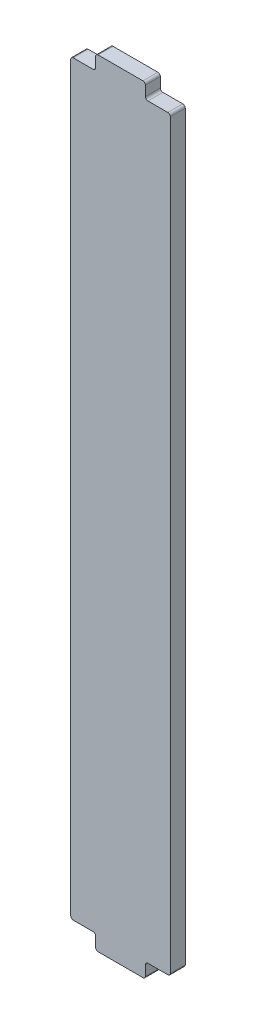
ISO-10303-21;
HEADER;
FILE_DESCRIPTION(('STEP AP214'),'2;1');
FILE_NAME('part.step','',(''),(''),'','','');
FILE_SCHEMA(('AUTOMOTIVE_DESIGN { 1 0 10303 214 1 1 1 1 }'));
ENDSEC;
DATA;
#1=APPLICATION_CONTEXT('core data for automotive mechanical design processes');
#2=APPLICATION_PROTOCOL_DEFINITION('international standard','automotive_design',2000,#1);
#3=PRODUCT_CONTEXT('',#1,'mechanical');
#4=PRODUCT('Part','Part','',(#3));
#5=PRODUCT_RELATED_PRODUCT_CATEGORY('part','',(#4));
#6=PRODUCT_DEFINITION_FORMATION('','',#4);
#7=PRODUCT_DEFINITION_CONTEXT('part definition',#1,'design');
#8=PRODUCT_DEFINITION('design','',#6,#7);
#9=PRODUCT_DEFINITION_SHAPE('','',#8);
#10=(LENGTH_UNIT() NAMED_UNIT(*) SI_UNIT(.MILLI.,.METRE.));
#11=(NAMED_UNIT(*) PLANE_ANGLE_UNIT() SI_UNIT($,.RADIAN.));
#12=(NAMED_UNIT(*) SI_UNIT($,.STERADIAN.) SOLID_ANGLE_UNIT());
#13=UNCERTAINTY_MEASURE_WITH_UNIT(LENGTH_MEASURE(1.E-05),#10,'distance_accuracy_value','');
#14=(GEOMETRIC_REPRESENTATION_CONTEXT(3) GLOBAL_UNCERTAINTY_ASSIGNED_CONTEXT((#13)) GLOBAL_UNIT_ASSIGNED_CONTEXT((#10,
#11,#12)) REPRESENTATION_CONTEXT('',''));
#15=CARTESIAN_POINT('',(0.,0.,0.));
#16=DIRECTION('',(0.,0.,1.));
#17=DIRECTION('',(1.,0.,0.));
#18=AXIS2_PLACEMENT_3D('',#15,#16,#17);
#19=CARTESIAN_POINT('',(8.99999999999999,1.,6.));
#20=DIRECTION('',(0.,0.,-1.));
#21=DIRECTION('',(-1.,0.,0.));
#22=AXIS2_PLACEMENT_3D('',#19,#20,#21);
#23=CYLINDRICAL_SURFACE('',#22,1.);
#24=CARTESIAN_POINT('',(8.99999999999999,1.,0.));
#25=DIRECTION('',(0.,0.,1.));
#26=DIRECTION('',(1.,0.,0.));
#27=AXIS2_PLACEMENT_3D('',#24,#25,#26);
#28=CIRCLE('',#27,1.);
#29=CARTESIAN_POINT('',(8.99999999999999,0.,0.));
#30=VERTEX_POINT('',#29);
#31=CARTESIAN_POINT('',(9.99999999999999,1.,0.));
#32=VERTEX_POINT('',#31);
#33=EDGE_CURVE('E231',#30,#32,#28,.T.);
#34=ORIENTED_EDGE('',*,*,#33,.T.);
#35=DIRECTION('',(0.,0.,-1.));
#36=VECTOR('',#35,1.);
#37=CARTESIAN_POINT('',(9.99999999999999,1.,6.));
#38=LINE('',#37,#36);
#39=CARTESIAN_POINT('',(9.99999999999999,1.,6.));
#40=VERTEX_POINT('',#39);
#41=EDGE_CURVE('E11',#40,#32,#38,.T.);
#42=ORIENTED_EDGE('',*,*,#41,.F.);
#43=CARTESIAN_POINT('',(8.99999999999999,1.,6.));
#44=DIRECTION('',(0.,0.,1.));
#45=DIRECTION('',(1.,0.,0.));
#46=AXIS2_PLACEMENT_3D('',#43,#44,#45);
#47=CIRCLE('',#46,1.);
#48=CARTESIAN_POINT('',(8.99999999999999,0.,6.));
#49=VERTEX_POINT('',#48);
#50=EDGE_CURVE('E277',#49,#40,#47,.T.);
#51=ORIENTED_EDGE('',*,*,#50,.F.);
#52=DIRECTION('',(0.,0.,-1.));
#53=VECTOR('',#52,1.);
#54=CARTESIAN_POINT('',(8.99999999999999,0.,6.));
#55=LINE('',#54,#53);
#56=EDGE_CURVE('E227',#49,#30,#55,.T.);
#57=ORIENTED_EDGE('',*,*,#56,.T.);
#58=EDGE_LOOP('',(#34,#42,#51,#57));
#59=FACE_BOUND('',#58,.T.);
#60=ADVANCED_FACE('F39',(#59),#23,.T.);
#61=CARTESIAN_POINT('',(9.99999999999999,1.,6.));
#62=DIRECTION('',(-1.,0.,0.));
#63=DIRECTION('',(0.,-1.,0.));
#64=AXIS2_PLACEMENT_3D('',#61,#62,#63);
#65=PLANE('',#64);
#66=DIRECTION('',(0.,1.,0.));
#67=VECTOR('',#66,1.);
#68=CARTESIAN_POINT('',(9.99999999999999,1.,0.));
#69=LINE('',#68,#67);
#70=CARTESIAN_POINT('',(9.99999999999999,5.,0.));
#71=VERTEX_POINT('',#70);
#72=EDGE_CURVE('E234',#32,#71,#69,.T.);
#73=ORIENTED_EDGE('',*,*,#72,.T.);
#74=DIRECTION('',(0.,0.,-1.));
#75=VECTOR('',#74,1.);
#76=CARTESIAN_POINT('',(9.99999999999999,5.,6.));
#77=LINE('',#76,#75);
#78=CARTESIAN_POINT('',(9.99999999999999,5.,6.));
#79=VERTEX_POINT('',#78);
#80=EDGE_CURVE('E47',#79,#71,#77,.T.);
#81=ORIENTED_EDGE('',*,*,#80,.F.);
#82=DIRECTION('',(0.,1.,0.));
#83=VECTOR('',#82,1.);
#84=CARTESIAN_POINT('',(9.99999999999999,1.,6.));
#85=LINE('',#84,#83);
#86=EDGE_CURVE('E146',#40,#79,#85,.T.);
#87=ORIENTED_EDGE('',*,*,#86,.F.);
#88=ORIENTED_EDGE('',*,*,#41,.T.);
#89=EDGE_LOOP('',(#73,#81,#87,#88));
#90=FACE_BOUND('',#89,.T.);
#91=ADVANCED_FACE('F415',(#90),#65,.F.);
#92=CARTESIAN_POINT('',(11.,5.,6.));
#93=DIRECTION('',(0.,0.,-1.));
#94=DIRECTION('',(-1.,0.,0.));
#95=AXIS2_PLACEMENT_3D('',#92,#93,#94);
#96=CYLINDRICAL_SURFACE('',#95,1.);
#97=CARTESIAN_POINT('',(11.,5.,0.));
#98=DIRECTION('',(0.,0.,-1.));
#99=DIRECTION('',(-1.,0.,0.));
#100=AXIS2_PLACEMENT_3D('',#97,#98,#99);
#101=CIRCLE('',#100,1.);
#102=CARTESIAN_POINT('',(11.,6.,0.));
#103=VERTEX_POINT('',#102);
#104=EDGE_CURVE('E236',#71,#103,#101,.T.);
#105=ORIENTED_EDGE('',*,*,#104,.T.);
#106=DIRECTION('',(0.,0.,-1.));
#107=VECTOR('',#106,1.);
#108=CARTESIAN_POINT('',(11.,6.,6.));
#109=LINE('',#108,#107);
#110=CARTESIAN_POINT('',(11.,6.,6.));
#111=VERTEX_POINT('',#110);
#112=EDGE_CURVE('E332',#111,#103,#109,.T.);
#113=ORIENTED_EDGE('',*,*,#112,.F.);
#114=CARTESIAN_POINT('',(11.,5.,6.));
#115=DIRECTION('',(0.,0.,-1.));
#116=DIRECTION('',(-1.,0.,0.));
#117=AXIS2_PLACEMENT_3D('',#114,#115,#116);
#118=CIRCLE('',#117,1.);
#119=EDGE_CURVE('E340',#79,#111,#118,.T.);
#120=ORIENTED_EDGE('',*,*,#119,.F.);
#121=ORIENTED_EDGE('',*,*,#80,.T.);
#122=EDGE_LOOP('',(#105,#113,#120,#121));
#123=FACE_BOUND('',#122,.T.);
#124=ADVANCED_FACE('F338',(#123),#96,.F.);
#125=CARTESIAN_POINT('',(11.,6.,6.));
#126=DIRECTION('',(0.,1.,0.));
#127=DIRECTION('',(-1.,0.,0.));
#128=AXIS2_PLACEMENT_3D('',#125,#126,#127);
#129=PLANE('',#128);
#130=DIRECTION('',(1.,0.,0.));
#131=VECTOR('',#130,1.);
#132=CARTESIAN_POINT('',(11.,6.,0.));
#133=LINE('',#132,#131);
#134=CARTESIAN_POINT('',(19.,6.00000000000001,0.));
#135=VERTEX_POINT('',#134);
#136=EDGE_CURVE('E238',#103,#135,#133,.T.);
#137=ORIENTED_EDGE('',*,*,#136,.T.);
#138=DIRECTION('',(0.,0.,-1.));
#139=VECTOR('',#138,1.);
#140=CARTESIAN_POINT('',(19.,6.00000000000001,6.));
#141=LINE('',#140,#139);
#142=CARTESIAN_POINT('',(19.,6.00000000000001,6.));
#143=VERTEX_POINT('',#142);
#144=EDGE_CURVE('E329',#143,#135,#141,.T.);
#145=ORIENTED_EDGE('',*,*,#144,.F.);
#146=DIRECTION('',(1.,0.,0.));
#147=VECTOR('',#146,1.);
#148=CARTESIAN_POINT('',(11.,6.,6.));
#149=LINE('',#148,#147);
#150=EDGE_CURVE('E358',#111,#143,#149,.T.);
#151=ORIENTED_EDGE('',*,*,#150,.F.);
#152=ORIENTED_EDGE('',*,*,#112,.T.);
#153=EDGE_LOOP('',(#137,#145,#151,#152));
#154=FACE_BOUND('',#153,.T.);
#155=ADVANCED_FACE('F349',(#154),#129,.F.);
#156=CARTESIAN_POINT('',(19.,7.00000000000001,6.));
#157=DIRECTION('',(0.,0.,-1.));
#158=DIRECTION('',(-1.,0.,0.));
#159=AXIS2_PLACEMENT_3D('',#156,#157,#158);
#160=CYLINDRICAL_SURFACE('',#159,0.999999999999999);
#161=CARTESIAN_POINT('',(19.,7.00000000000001,0.));
#162=DIRECTION('',(0.,0.,1.));
#163=DIRECTION('',(1.,0.,0.));
#164=AXIS2_PLACEMENT_3D('',#161,#162,#163);
#165=CIRCLE('',#164,0.999999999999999);
#166=CARTESIAN_POINT('',(20.,7.00000000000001,0.));
#167=VERTEX_POINT('',#166);
#168=EDGE_CURVE('E240',#135,#167,#165,.T.);
#169=ORIENTED_EDGE('',*,*,#168,.T.);
#170=DIRECTION('',(0.,0.,-1.));
#171=VECTOR('',#170,1.);
#172=CARTESIAN_POINT('',(20.,7.00000000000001,6.));
#173=LINE('',#172,#171);
#174=CARTESIAN_POINT('',(20.,7.00000000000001,6.));
#175=VERTEX_POINT('',#174);
#176=EDGE_CURVE('E326',#175,#167,#173,.T.);
#177=ORIENTED_EDGE('',*,*,#176,.F.);
#178=CARTESIAN_POINT('',(19.,7.00000000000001,6.));
#179=DIRECTION('',(0.,0.,1.));
#180=DIRECTION('',(1.,0.,0.));
#181=AXIS2_PLACEMENT_3D('',#178,#179,#180);
#182=CIRCLE('',#181,0.999999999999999);
#183=EDGE_CURVE('E355',#143,#175,#182,.T.);
#184=ORIENTED_EDGE('',*,*,#183,.F.);
#185=ORIENTED_EDGE('',*,*,#144,.T.);
#186=EDGE_LOOP('',(#169,#177,#184,#185));
#187=FACE_BOUND('',#186,.T.);
#188=ADVANCED_FACE('F353',(#187),#160,.T.);
#189=CARTESIAN_POINT('',(20.,7.00000000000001,6.));
#190=DIRECTION('',(-1.,0.,0.));
#191=DIRECTION('',(0.,-1.,0.));
#192=AXIS2_PLACEMENT_3D('',#189,#190,#191);
#193=PLANE('',#192);
#194=DIRECTION('',(0.,1.,0.));
#195=VECTOR('',#194,1.);
#196=CARTESIAN_POINT('',(20.,7.00000000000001,0.));
#197=LINE('',#196,#195);
#198=CARTESIAN_POINT('',(20.,305.,0.));
#199=VERTEX_POINT('',#198);
#200=EDGE_CURVE('E242',#167,#199,#197,.T.);
#201=ORIENTED_EDGE('',*,*,#200,.T.);
#202=DIRECTION('',(0.,0.,-1.));
#203=VECTOR('',#202,1.);
#204=CARTESIAN_POINT('',(20.,305.,6.));
#205=LINE('',#204,#203);
#206=CARTESIAN_POINT('',(20.,305.,6.));
#207=VERTEX_POINT('',#206);
#208=EDGE_CURVE('E323',#207,#199,#205,.T.);
#209=ORIENTED_EDGE('',*,*,#208,.F.);
#210=DIRECTION('',(0.,1.,0.));
#211=VECTOR('',#210,1.);
#212=CARTESIAN_POINT('',(20.,7.00000000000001,6.));
#213=LINE('',#212,#211);
#214=EDGE_CURVE('E357',#175,#207,#213,.T.);
#215=ORIENTED_EDGE('',*,*,#214,.F.);
#216=ORIENTED_EDGE('',*,*,#176,.T.);
#217=EDGE_LOOP('',(#201,#209,#215,#216));
#218=FACE_BOUND('',#217,.T.);
#219=ADVANCED_FACE('F428',(#218),#193,.F.);
#220=CARTESIAN_POINT('',(19.,305.,6.));
#221=DIRECTION('',(0.,0.,-1.));
#222=DIRECTION('',(-1.,0.,0.));
#223=AXIS2_PLACEMENT_3D('',#220,#221,#222);
#224=CYLINDRICAL_SURFACE('',#223,1.);
#225=CARTESIAN_POINT('',(19.,305.,0.));
#226=DIRECTION('',(0.,0.,1.));
#227=DIRECTION('',(1.,0.,0.));
#228=AXIS2_PLACEMENT_3D('',#225,#226,#227);
#229=CIRCLE('',#228,1.);
#230=CARTESIAN_POINT('',(19.,306.,0.));
#231=VERTEX_POINT('',#230);
#232=EDGE_CURVE('E244',#199,#231,#229,.T.);
#233=ORIENTED_EDGE('',*,*,#232,.T.);
#234=DIRECTION('',(0.,0.,-1.));
#235=VECTOR('',#234,1.);
#236=CARTESIAN_POINT('',(19.,306.,6.));
#237=LINE('',#236,#235);
#238=CARTESIAN_POINT('',(19.,306.,6.));
#239=VERTEX_POINT('',#238);
#240=EDGE_CURVE('E320',#239,#231,#237,.T.);
#241=ORIENTED_EDGE('',*,*,#240,.F.);
#242=CARTESIAN_POINT('',(19.,305.,6.));
#243=DIRECTION('',(0.,0.,1.));
#244=DIRECTION('',(1.,0.,0.));
#245=AXIS2_PLACEMENT_3D('',#242,#243,#244);
#246=CIRCLE('',#245,1.);
#247=EDGE_CURVE('E360',#207,#239,#246,.T.);
#248=ORIENTED_EDGE('',*,*,#247,.F.);
#249=ORIENTED_EDGE('',*,*,#208,.T.);
#250=EDGE_LOOP('',(#233,#241,#248,#249));
#251=FACE_BOUND('',#250,.T.);
#252=ADVANCED_FACE('F431',(#251),#224,.T.);
#253=CARTESIAN_POINT('',(19.,306.,6.));
#254=DIRECTION('',(0.,-1.,0.));
#255=DIRECTION('',(0.,0.,-1.));
#256=AXIS2_PLACEMENT_3D('',#253,#254,#255);
#257=PLANE('',#256);
#258=DIRECTION('',(-1.,0.,0.));
#259=VECTOR('',#258,1.);
#260=CARTESIAN_POINT('',(19.,306.,0.));
#261=LINE('',#260,#259);
#262=CARTESIAN_POINT('',(11.,306.,0.));
#263=VERTEX_POINT('',#262);
#264=EDGE_CURVE('E246',#231,#263,#261,.T.);
#265=ORIENTED_EDGE('',*,*,#264,.T.);
#266=DIRECTION('',(0.,0.,-1.));
#267=VECTOR('',#266,1.);
#268=CARTESIAN_POINT('',(11.,306.,6.));
#269=LINE('',#268,#267);
#270=CARTESIAN_POINT('',(11.,306.,6.));
#271=VERTEX_POINT('',#270);
#272=EDGE_CURVE('E317',#271,#263,#269,.T.);
#273=ORIENTED_EDGE('',*,*,#272,.F.);
#274=DIRECTION('',(-1.,0.,0.));
#275=VECTOR('',#274,1.);
#276=CARTESIAN_POINT('',(19.,306.,6.));
#277=LINE('',#276,#275);
#278=EDGE_CURVE('E366',#239,#271,#277,.T.);
#279=ORIENTED_EDGE('',*,*,#278,.F.);
#280=ORIENTED_EDGE('',*,*,#240,.T.);
#281=EDGE_LOOP('',(#265,#273,#279,#280));
#282=FACE_BOUND('',#281,.T.);
#283=ADVANCED_FACE('F435',(#282),#257,.F.);
#284=CARTESIAN_POINT('',(11.,307.,6.));
#285=DIRECTION('',(0.,0.,-1.));
#286=DIRECTION('',(-1.,0.,0.));
#287=AXIS2_PLACEMENT_3D('',#284,#285,#286);
#288=CYLINDRICAL_SURFACE('',#287,0.999999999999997);
#289=CARTESIAN_POINT('',(11.,307.,0.));
#290=DIRECTION('',(0.,0.,-1.));
#291=DIRECTION('',(-1.,0.,0.));
#292=AXIS2_PLACEMENT_3D('',#289,#290,#291);
#293=CIRCLE('',#292,0.999999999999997);
#294=CARTESIAN_POINT('',(9.99999999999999,307.,0.));
#295=VERTEX_POINT('',#294);
#296=EDGE_CURVE('E248',#263,#295,#293,.T.);
#297=ORIENTED_EDGE('',*,*,#296,.T.);
#298=DIRECTION('',(0.,0.,-1.));
#299=VECTOR('',#298,1.);
#300=CARTESIAN_POINT('',(9.99999999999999,307.,6.));
#301=LINE('',#300,#299);
#302=CARTESIAN_POINT('',(9.99999999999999,307.,6.));
#303=VERTEX_POINT('',#302);
#304=EDGE_CURVE('E314',#303,#295,#301,.T.);
#305=ORIENTED_EDGE('',*,*,#304,.F.);
#306=CARTESIAN_POINT('',(11.,307.,6.));
#307=DIRECTION('',(0.,0.,-1.));
#308=DIRECTION('',(-1.,0.,0.));
#309=AXIS2_PLACEMENT_3D('',#306,#307,#308);
#310=CIRCLE('',#309,0.999999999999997);
#311=EDGE_CURVE('E368',#271,#303,#310,.T.);
#312=ORIENTED_EDGE('',*,*,#311,.F.);
#313=ORIENTED_EDGE('',*,*,#272,.T.);
#314=EDGE_LOOP('',(#297,#305,#312,#313));
#315=FACE_BOUND('',#314,.T.);
#316=ADVANCED_FACE('F439',(#315),#288,.F.);
#317=CARTESIAN_POINT('',(9.99999999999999,307.,6.));
#318=DIRECTION('',(-1.,0.,0.));
#319=DIRECTION('',(0.,0.,1.));
#320=AXIS2_PLACEMENT_3D('',#317,#318,#319);
#321=PLANE('',#320);
#322=DIRECTION('',(0.,1.,0.));
#323=VECTOR('',#322,1.);
#324=CARTESIAN_POINT('',(9.99999999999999,307.,0.));
#325=LINE('',#324,#323);
#326=CARTESIAN_POINT('',(10.,311.,0.));
#327=VERTEX_POINT('',#326);
#328=EDGE_CURVE('E250',#295,#327,#325,.T.);
#329=ORIENTED_EDGE('',*,*,#328,.T.);
#330=DIRECTION('',(0.,0.,-1.));
#331=VECTOR('',#330,1.);
#332=CARTESIAN_POINT('',(10.,311.,6.));
#333=LINE('',#332,#331);
#334=CARTESIAN_POINT('',(10.,311.,6.));
#335=VERTEX_POINT('',#334);
#336=EDGE_CURVE('E311',#335,#327,#333,.T.);
#337=ORIENTED_EDGE('',*,*,#336,.F.);
#338=DIRECTION('',(0.,1.,0.));
#339=VECTOR('',#338,1.);
#340=CARTESIAN_POINT('',(9.99999999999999,307.,6.));
#341=LINE('',#340,#339);
#342=EDGE_CURVE('E370',#303,#335,#341,.T.);
#343=ORIENTED_EDGE('',*,*,#342,.F.);
#344=ORIENTED_EDGE('',*,*,#304,.T.);
#345=EDGE_LOOP('',(#329,#337,#343,#344));
#346=FACE_BOUND('',#345,.T.);
#347=ADVANCED_FACE('F443',(#346),#321,.F.);
#348=CARTESIAN_POINT('',(9.,311.,6.));
#349=DIRECTION('',(0.,0.,-1.));
#350=DIRECTION('',(-1.,0.,0.));
#351=AXIS2_PLACEMENT_3D('',#348,#349,#350);
#352=CYLINDRICAL_SURFACE('',#351,1.00000000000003);
#353=CARTESIAN_POINT('',(9.,311.,0.));
#354=DIRECTION('',(0.,0.,1.));
#355=DIRECTION('',(1.,0.,0.));
#356=AXIS2_PLACEMENT_3D('',#353,#354,#355);
#357=CIRCLE('',#356,1.00000000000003);
#358=CARTESIAN_POINT('',(9.,312.,0.));
#359=VERTEX_POINT('',#358);
#360=EDGE_CURVE('E252',#327,#359,#357,.T.);
#361=ORIENTED_EDGE('',*,*,#360,.T.);
#362=DIRECTION('',(0.,0.,-1.));
#363=VECTOR('',#362,1.);
#364=CARTESIAN_POINT('',(9.,312.,6.));
#365=LINE('',#364,#363);
#366=CARTESIAN_POINT('',(9.,312.,6.));
#367=VERTEX_POINT('',#366);
#368=EDGE_CURVE('E308',#367,#359,#365,.T.);
#369=ORIENTED_EDGE('',*,*,#368,.F.);
#370=CARTESIAN_POINT('',(9.,311.,6.));
#371=DIRECTION('',(0.,0.,1.));
#372=DIRECTION('',(1.,0.,0.));
#373=AXIS2_PLACEMENT_3D('',#370,#371,#372);
#374=CIRCLE('',#373,1.00000000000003);
#375=EDGE_CURVE('E372',#335,#367,#374,.T.);
#376=ORIENTED_EDGE('',*,*,#375,.F.);
#377=ORIENTED_EDGE('',*,*,#336,.T.);
#378=EDGE_LOOP('',(#361,#369,#376,#377));
#379=FACE_BOUND('',#378,.T.);
#380=ADVANCED_FACE('F447',(#379),#352,.T.);
#381=CARTESIAN_POINT('',(9.,312.,6.));
#382=DIRECTION('',(0.,-1.,0.));
#383=DIRECTION('',(0.,0.,-1.));
#384=AXIS2_PLACEMENT_3D('',#381,#382,#383);
#385=PLANE('',#384);
#386=DIRECTION('',(-1.,0.,0.));
#387=VECTOR('',#386,1.);
#388=CARTESIAN_POINT('',(9.,312.,0.));
#389=LINE('',#388,#387);
#390=CARTESIAN_POINT('',(-9.,312.,0.));
#391=VERTEX_POINT('',#390);
#392=EDGE_CURVE('E254',#359,#391,#389,.T.);
#393=ORIENTED_EDGE('',*,*,#392,.T.);
#394=DIRECTION('',(0.,0.,-1.));
#395=VECTOR('',#394,1.);
#396=CARTESIAN_POINT('',(-9.,312.,6.));
#397=LINE('',#396,#395);
#398=CARTESIAN_POINT('',(-9.,312.,6.));
#399=VERTEX_POINT('',#398);
#400=EDGE_CURVE('E305',#399,#391,#397,.T.);
#401=ORIENTED_EDGE('',*,*,#400,.F.);
#402=DIRECTION('',(-1.,0.,0.));
#403=VECTOR('',#402,1.);
#404=CARTESIAN_POINT('',(9.,312.,6.));
#405=LINE('',#404,#403);
#406=EDGE_CURVE('E374',#367,#399,#405,.T.);
#407=ORIENTED_EDGE('',*,*,#406,.F.);
#408=ORIENTED_EDGE('',*,*,#368,.T.);
#409=EDGE_LOOP('',(#393,#401,#407,#408));
#410=FACE_BOUND('',#409,.T.);
#411=ADVANCED_FACE('F451',(#410),#385,.F.);
#412=CARTESIAN_POINT('',(-9.,311.,6.));
#413=DIRECTION('',(0.,0.,-1.));
#414=DIRECTION('',(-1.,0.,0.));
#415=AXIS2_PLACEMENT_3D('',#412,#413,#414);
#416=CYLINDRICAL_SURFACE('',#415,1.00000000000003);
#417=CARTESIAN_POINT('',(-9.,311.,0.));
#418=DIRECTION('',(0.,0.,1.));
#419=DIRECTION('',(1.,0.,0.));
#420=AXIS2_PLACEMENT_3D('',#417,#418,#419);
#421=CIRCLE('',#420,1.00000000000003);
#422=CARTESIAN_POINT('',(-9.99999999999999,311.,0.));
#423=VERTEX_POINT('',#422);
#424=EDGE_CURVE('E256',#391,#423,#421,.T.);
#425=ORIENTED_EDGE('',*,*,#424,.T.);
#426=DIRECTION('',(0.,0.,-1.));
#427=VECTOR('',#426,1.);
#428=CARTESIAN_POINT('',(-9.99999999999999,311.,6.));
#429=LINE('',#428,#427);
#430=CARTESIAN_POINT('',(-9.99999999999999,311.,6.));
#431=VERTEX_POINT('',#430);
#432=EDGE_CURVE('E302',#431,#423,#429,.T.);
#433=ORIENTED_EDGE('',*,*,#432,.F.);
#434=CARTESIAN_POINT('',(-9.,311.,6.));
#435=DIRECTION('',(0.,0.,1.));
#436=DIRECTION('',(1.,0.,0.));
#437=AXIS2_PLACEMENT_3D('',#434,#435,#436);
#438=CIRCLE('',#437,1.00000000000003);
#439=EDGE_CURVE('E376',#399,#431,#438,.T.);
#440=ORIENTED_EDGE('',*,*,#439,.F.);
#441=ORIENTED_EDGE('',*,*,#400,.T.);
#442=EDGE_LOOP('',(#425,#433,#440,#441));
#443=FACE_BOUND('',#442,.T.);
#444=ADVANCED_FACE('F455',(#443),#416,.T.);
#445=CARTESIAN_POINT('',(-9.99999999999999,307.,6.));
#446=DIRECTION('',(1.,0.,0.));
#447=DIRECTION('',(0.,0.,-1.));
#448=AXIS2_PLACEMENT_3D('',#445,#446,#447);
#449=PLANE('',#448);
#450=DIRECTION('',(0.,-1.,0.));
#451=VECTOR('',#450,1.);
#452=CARTESIAN_POINT('',(-9.99999999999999,307.,0.));
#453=LINE('',#452,#451);
#454=CARTESIAN_POINT('',(-9.99999999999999,307.,0.));
#455=VERTEX_POINT('',#454);
#456=EDGE_CURVE('E258',#423,#455,#453,.T.);
#457=ORIENTED_EDGE('',*,*,#456,.T.);
#458=DIRECTION('',(0.,0.,-1.));
#459=VECTOR('',#458,1.);
#460=CARTESIAN_POINT('',(-9.99999999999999,307.,6.));
#461=LINE('',#460,#459);
#462=CARTESIAN_POINT('',(-9.99999999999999,307.,6.));
#463=VERTEX_POINT('',#462);
#464=EDGE_CURVE('E299',#463,#455,#461,.T.);
#465=ORIENTED_EDGE('',*,*,#464,.F.);
#466=DIRECTION('',(0.,-1.,0.));
#467=VECTOR('',#466,1.);
#468=CARTESIAN_POINT('',(-9.99999999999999,307.,6.));
#469=LINE('',#468,#467);
#470=EDGE_CURVE('E378',#431,#463,#469,.T.);
#471=ORIENTED_EDGE('',*,*,#470,.F.);
#472=ORIENTED_EDGE('',*,*,#432,.T.);
#473=EDGE_LOOP('',(#457,#465,#471,#472));
#474=FACE_BOUND('',#473,.T.);
#475=ADVANCED_FACE('F459',(#474),#449,.F.);
#476=CARTESIAN_POINT('',(-11.,307.,6.));
#477=DIRECTION('',(0.,0.,-1.));
#478=DIRECTION('',(-1.,0.,0.));
#479=AXIS2_PLACEMENT_3D('',#476,#477,#478);
#480=CYLINDRICAL_SURFACE('',#479,1.);
#481=CARTESIAN_POINT('',(-11.,307.,0.));
#482=DIRECTION('',(0.,0.,-1.));
#483=DIRECTION('',(-1.,0.,0.));
#484=AXIS2_PLACEMENT_3D('',#481,#482,#483);
#485=CIRCLE('',#484,1.);
#486=CARTESIAN_POINT('',(-11.,306.,0.));
#487=VERTEX_POINT('',#486);
#488=EDGE_CURVE('E260',#455,#487,#485,.T.);
#489=ORIENTED_EDGE('',*,*,#488,.T.);
#490=DIRECTION('',(0.,0.,-1.));
#491=VECTOR('',#490,1.);
#492=CARTESIAN_POINT('',(-11.,306.,6.));
#493=LINE('',#492,#491);
#494=CARTESIAN_POINT('',(-11.,306.,6.));
#495=VERTEX_POINT('',#494);
#496=EDGE_CURVE('E296',#495,#487,#493,.T.);
#497=ORIENTED_EDGE('',*,*,#496,.F.);
#498=CARTESIAN_POINT('',(-11.,307.,6.));
#499=DIRECTION('',(0.,0.,-1.));
#500=DIRECTION('',(-1.,0.,0.));
#501=AXIS2_PLACEMENT_3D('',#498,#499,#500);
#502=CIRCLE('',#501,1.);
#503=EDGE_CURVE('E380',#463,#495,#502,.T.);
#504=ORIENTED_EDGE('',*,*,#503,.F.);
#505=ORIENTED_EDGE('',*,*,#464,.T.);
#506=EDGE_LOOP('',(#489,#497,#504,#505));
#507=FACE_BOUND('',#506,.T.);
#508=ADVANCED_FACE('F463',(#507),#480,.F.);
#509=CARTESIAN_POINT('',(-19.,306.,6.));
#510=DIRECTION('',(0.,-1.,0.));
#511=DIRECTION('',(0.,0.,-1.));
#512=AXIS2_PLACEMENT_3D('',#509,#510,#511);
#513=PLANE('',#512);
#514=DIRECTION('',(-1.,0.,0.));
#515=VECTOR('',#514,1.);
#516=CARTESIAN_POINT('',(-19.,306.,0.));
#517=LINE('',#516,#515);
#518=CARTESIAN_POINT('',(-19.,306.,0.));
#519=VERTEX_POINT('',#518);
#520=EDGE_CURVE('E262',#487,#519,#517,.T.);
#521=ORIENTED_EDGE('',*,*,#520,.T.);
#522=DIRECTION('',(0.,0.,-1.));
#523=VECTOR('',#522,1.);
#524=CARTESIAN_POINT('',(-19.,306.,6.));
#525=LINE('',#524,#523);
#526=CARTESIAN_POINT('',(-19.,306.,6.));
#527=VERTEX_POINT('',#526);
#528=EDGE_CURVE('E293',#527,#519,#525,.T.);
#529=ORIENTED_EDGE('',*,*,#528,.F.);
#530=DIRECTION('',(-1.,0.,0.));
#531=VECTOR('',#530,1.);
#532=CARTESIAN_POINT('',(-19.,306.,6.));
#533=LINE('',#532,#531);
#534=EDGE_CURVE('E382',#495,#527,#533,.T.);
#535=ORIENTED_EDGE('',*,*,#534,.F.);
#536=ORIENTED_EDGE('',*,*,#496,.T.);
#537=EDGE_LOOP('',(#521,#529,#535,#536));
#538=FACE_BOUND('',#537,.T.);
#539=ADVANCED_FACE('F467',(#538),#513,.F.);
#540=CARTESIAN_POINT('',(-19.,305.,6.));
#541=DIRECTION('',(0.,0.,-1.));
#542=DIRECTION('',(-1.,0.,0.));
#543=AXIS2_PLACEMENT_3D('',#540,#541,#542);
#544=CYLINDRICAL_SURFACE('',#543,0.999999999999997);
#545=CARTESIAN_POINT('',(-19.,305.,0.));
#546=DIRECTION('',(0.,0.,1.));
#547=DIRECTION('',(1.,0.,0.));
#548=AXIS2_PLACEMENT_3D('',#545,#546,#547);
#549=CIRCLE('',#548,0.999999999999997);
#550=CARTESIAN_POINT('',(-20.,305.,0.));
#551=VERTEX_POINT('',#550);
#552=EDGE_CURVE('E264',#519,#551,#549,.T.);
#553=ORIENTED_EDGE('',*,*,#552,.T.);
#554=DIRECTION('',(0.,0.,-1.));
#555=VECTOR('',#554,1.);
#556=CARTESIAN_POINT('',(-20.,305.,6.));
#557=LINE('',#556,#555);
#558=CARTESIAN_POINT('',(-20.,305.,6.));
#559=VERTEX_POINT('',#558);
#560=EDGE_CURVE('E290',#559,#551,#557,.T.);
#561=ORIENTED_EDGE('',*,*,#560,.F.);
#562=CARTESIAN_POINT('',(-19.,305.,6.));
#563=DIRECTION('',(0.,0.,1.));
#564=DIRECTION('',(1.,0.,0.));
#565=AXIS2_PLACEMENT_3D('',#562,#563,#564);
#566=CIRCLE('',#565,0.999999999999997);
#567=EDGE_CURVE('E384',#527,#559,#566,.T.);
#568=ORIENTED_EDGE('',*,*,#567,.F.);
#569=ORIENTED_EDGE('',*,*,#528,.T.);
#570=EDGE_LOOP('',(#553,#561,#568,#569));
#571=FACE_BOUND('',#570,.T.);
#572=ADVANCED_FACE('F471',(#571),#544,.T.);
#573=CARTESIAN_POINT('',(-20.,7.00000000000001,6.));
#574=DIRECTION('',(1.,0.,0.));
#575=DIRECTION('',(0.,1.,0.));
#576=AXIS2_PLACEMENT_3D('',#573,#574,#575);
#577=PLANE('',#576);
#578=DIRECTION('',(0.,-1.,0.));
#579=VECTOR('',#578,1.);
#580=CARTESIAN_POINT('',(-20.,7.00000000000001,0.));
#581=LINE('',#580,#579);
#582=CARTESIAN_POINT('',(-20.,7.00000000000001,0.));
#583=VERTEX_POINT('',#582);
#584=EDGE_CURVE('E266',#551,#583,#581,.T.);
#585=ORIENTED_EDGE('',*,*,#584,.T.);
#586=DIRECTION('',(0.,0.,-1.));
#587=VECTOR('',#586,1.);
#588=CARTESIAN_POINT('',(-20.,7.00000000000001,6.));
#589=LINE('',#588,#587);
#590=CARTESIAN_POINT('',(-20.,7.00000000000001,6.));
#591=VERTEX_POINT('',#590);
#592=EDGE_CURVE('E287',#591,#583,#589,.T.);
#593=ORIENTED_EDGE('',*,*,#592,.F.);
#594=DIRECTION('',(0.,-1.,0.));
#595=VECTOR('',#594,1.);
#596=CARTESIAN_POINT('',(-20.,7.00000000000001,6.));
#597=LINE('',#596,#595);
#598=EDGE_CURVE('E386',#559,#591,#597,.T.);
#599=ORIENTED_EDGE('',*,*,#598,.F.);
#600=ORIENTED_EDGE('',*,*,#560,.T.);
#601=EDGE_LOOP('',(#585,#593,#599,#600));
#602=FACE_BOUND('',#601,.T.);
#603=ADVANCED_FACE('F475',(#602),#577,.F.);
#604=CARTESIAN_POINT('',(-19.,7.00000000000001,6.));
#605=DIRECTION('',(0.,0.,-1.));
#606=DIRECTION('',(-1.,0.,0.));
#607=AXIS2_PLACEMENT_3D('',#604,#605,#606);
#608=CYLINDRICAL_SURFACE('',#607,0.999999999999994);
#609=CARTESIAN_POINT('',(-19.,7.00000000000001,0.));
#610=DIRECTION('',(0.,0.,1.));
#611=DIRECTION('',(1.,0.,0.));
#612=AXIS2_PLACEMENT_3D('',#609,#610,#611);
#613=CIRCLE('',#612,0.999999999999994);
#614=CARTESIAN_POINT('',(-19.,6.00000000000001,0.));
#615=VERTEX_POINT('',#614);
#616=EDGE_CURVE('E268',#583,#615,#613,.T.);
#617=ORIENTED_EDGE('',*,*,#616,.T.);
#618=DIRECTION('',(0.,0.,-1.));
#619=VECTOR('',#618,1.);
#620=CARTESIAN_POINT('',(-19.,6.00000000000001,6.));
#621=LINE('',#620,#619);
#622=CARTESIAN_POINT('',(-19.,6.00000000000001,6.));
#623=VERTEX_POINT('',#622);
#624=EDGE_CURVE('E284',#623,#615,#621,.T.);
#625=ORIENTED_EDGE('',*,*,#624,.F.);
#626=CARTESIAN_POINT('',(-19.,7.00000000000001,6.));
#627=DIRECTION('',(0.,0.,1.));
#628=DIRECTION('',(1.,0.,0.));
#629=AXIS2_PLACEMENT_3D('',#626,#627,#628);
#630=CIRCLE('',#629,0.999999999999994);
#631=EDGE_CURVE('E388',#591,#623,#630,.T.);
#632=ORIENTED_EDGE('',*,*,#631,.F.);
#633=ORIENTED_EDGE('',*,*,#592,.T.);
#634=EDGE_LOOP('',(#617,#625,#632,#633));
#635=FACE_BOUND('',#634,.T.);
#636=ADVANCED_FACE('F479',(#635),#608,.T.);
#637=CARTESIAN_POINT('',(-11.,6.,6.));
#638=DIRECTION('',(0.,1.,0.));
#639=DIRECTION('',(-1.,0.,0.));
#640=AXIS2_PLACEMENT_3D('',#637,#638,#639);
#641=PLANE('',#640);
#642=DIRECTION('',(1.,0.,0.));
#643=VECTOR('',#642,1.);
#644=CARTESIAN_POINT('',(-11.,6.,0.));
#645=LINE('',#644,#643);
#646=CARTESIAN_POINT('',(-11.,6.00000000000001,0.));
#647=VERTEX_POINT('',#646);
#648=EDGE_CURVE('E270',#615,#647,#645,.T.);
#649=ORIENTED_EDGE('',*,*,#648,.T.);
#650=DIRECTION('',(0.,0.,-1.));
#651=VECTOR('',#650,1.);
#652=CARTESIAN_POINT('',(-11.,6.00000000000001,6.));
#653=LINE('',#652,#651);
#654=CARTESIAN_POINT('',(-11.,6.00000000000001,6.));
#655=VERTEX_POINT('',#654);
#656=EDGE_CURVE('E281',#655,#647,#653,.T.);
#657=ORIENTED_EDGE('',*,*,#656,.F.);
#658=DIRECTION('',(1.,0.,0.));
#659=VECTOR('',#658,1.);
#660=CARTESIAN_POINT('',(-11.,6.,6.));
#661=LINE('',#660,#659);
#662=EDGE_CURVE('E390',#623,#655,#661,.T.);
#663=ORIENTED_EDGE('',*,*,#662,.F.);
#664=ORIENTED_EDGE('',*,*,#624,.T.);
#665=EDGE_LOOP('',(#649,#657,#663,#664));
#666=FACE_BOUND('',#665,.T.);
#667=ADVANCED_FACE('F396',(#666),#641,.F.);
#668=CARTESIAN_POINT('',(-11.,5.,6.));
#669=DIRECTION('',(0.,0.,-1.));
#670=DIRECTION('',(-1.,0.,0.));
#671=AXIS2_PLACEMENT_3D('',#668,#669,#670);
#672=CYLINDRICAL_SURFACE('',#671,1.00000000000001);
#673=CARTESIAN_POINT('',(-11.,5.,0.));
#674=DIRECTION('',(0.,0.,-1.));
#675=DIRECTION('',(-1.,0.,0.));
#676=AXIS2_PLACEMENT_3D('',#673,#674,#675);
#677=CIRCLE('',#676,1.00000000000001);
#678=CARTESIAN_POINT('',(-9.99999999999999,5.,0.));
#679=VERTEX_POINT('',#678);
#680=EDGE_CURVE('E272',#647,#679,#677,.T.);
#681=ORIENTED_EDGE('',*,*,#680,.T.);
#682=DIRECTION('',(0.,0.,-1.));
#683=VECTOR('',#682,1.);
#684=CARTESIAN_POINT('',(-9.99999999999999,5.,6.));
#685=LINE('',#684,#683);
#686=CARTESIAN_POINT('',(-9.99999999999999,5.,6.));
#687=VERTEX_POINT('',#686);
#688=EDGE_CURVE('E222',#687,#679,#685,.T.);
#689=ORIENTED_EDGE('',*,*,#688,.F.);
#690=CARTESIAN_POINT('',(-11.,5.,6.));
#691=DIRECTION('',(0.,0.,-1.));
#692=DIRECTION('',(-1.,0.,0.));
#693=AXIS2_PLACEMENT_3D('',#690,#691,#692);
#694=CIRCLE('',#693,1.00000000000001);
#695=EDGE_CURVE('E213',#655,#687,#694,.T.);
#696=ORIENTED_EDGE('',*,*,#695,.F.);
#697=ORIENTED_EDGE('',*,*,#656,.T.);
#698=EDGE_LOOP('',(#681,#689,#696,#697));
#699=FACE_BOUND('',#698,.T.);
#700=ADVANCED_FACE('F400',(#699),#672,.F.);
#701=CARTESIAN_POINT('',(-9.99999999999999,1.,6.));
#702=DIRECTION('',(1.,0.,0.));
#703=DIRECTION('',(0.,1.,0.));
#704=AXIS2_PLACEMENT_3D('',#701,#702,#703);
#705=PLANE('',#704);
#706=DIRECTION('',(0.,-1.,0.));
#707=VECTOR('',#706,1.);
#708=CARTESIAN_POINT('',(-9.99999999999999,1.,0.));
#709=LINE('',#708,#707);
#710=CARTESIAN_POINT('',(-10.,1.,0.));
#711=VERTEX_POINT('',#710);
#712=EDGE_CURVE('E221',#679,#711,#709,.T.);
#713=ORIENTED_EDGE('',*,*,#712,.T.);
#714=DIRECTION('',(0.,0.,-1.));
#715=VECTOR('',#714,1.);
#716=CARTESIAN_POINT('',(-10.,1.,6.));
#717=LINE('',#716,#715);
#718=CARTESIAN_POINT('',(-10.,1.,6.));
#719=VERTEX_POINT('',#718);
#720=EDGE_CURVE('E218',#719,#711,#717,.T.);
#721=ORIENTED_EDGE('',*,*,#720,.F.);
#722=DIRECTION('',(0.,-1.,0.));
#723=VECTOR('',#722,1.);
#724=CARTESIAN_POINT('',(-9.99999999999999,1.,6.));
#725=LINE('',#724,#723);
#726=EDGE_CURVE('E207',#687,#719,#725,.T.);
#727=ORIENTED_EDGE('',*,*,#726,.F.);
#728=ORIENTED_EDGE('',*,*,#688,.T.);
#729=EDGE_LOOP('',(#713,#721,#727,#728));
#730=FACE_BOUND('',#729,.T.);
#731=ADVANCED_FACE('F219',(#730),#705,.F.);
#732=CARTESIAN_POINT('',(-9.,1.,6.));
#733=DIRECTION('',(0.,0.,-1.));
#734=DIRECTION('',(-1.,0.,0.));
#735=AXIS2_PLACEMENT_3D('',#732,#733,#734);
#736=CYLINDRICAL_SURFACE('',#735,0.999999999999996);
#737=CARTESIAN_POINT('',(-9.,1.,0.));
#738=DIRECTION('',(0.,0.,1.));
#739=DIRECTION('',(-1.,0.,0.));
#740=AXIS2_PLACEMENT_3D('',#737,#738,#739);
#741=CIRCLE('',#740,0.999999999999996);
#742=CARTESIAN_POINT('',(-8.99999999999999,0.,0.));
#743=VERTEX_POINT('',#742);
#744=EDGE_CURVE('E132',#711,#743,#741,.T.);
#745=ORIENTED_EDGE('',*,*,#744,.T.);
#746=DIRECTION('',(0.,0.,-1.));
#747=VECTOR('',#746,1.);
#748=CARTESIAN_POINT('',(-8.99999999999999,0.,6.));
#749=LINE('',#748,#747);
#750=CARTESIAN_POINT('',(-8.99999999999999,0.,6.));
#751=VERTEX_POINT('',#750);
#752=EDGE_CURVE('E223',#751,#743,#749,.T.);
#753=ORIENTED_EDGE('',*,*,#752,.F.);
#754=CARTESIAN_POINT('',(-9.,1.,6.));
#755=DIRECTION('',(0.,0.,1.));
#756=DIRECTION('',(-1.,0.,0.));
#757=AXIS2_PLACEMENT_3D('',#754,#755,#756);
#758=CIRCLE('',#757,0.999999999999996);
#759=EDGE_CURVE('E211',#719,#751,#758,.T.);
#760=ORIENTED_EDGE('',*,*,#759,.F.);
#761=ORIENTED_EDGE('',*,*,#720,.T.);
#762=EDGE_LOOP('',(#745,#753,#760,#761));
#763=FACE_BOUND('',#762,.T.);
#764=ADVANCED_FACE('F225',(#763),#736,.T.);
#765=CARTESIAN_POINT('',(-8.99999999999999,0.,6.));
#766=DIRECTION('',(0.,1.,0.));
#767=DIRECTION('',(0.,0.,1.));
#768=AXIS2_PLACEMENT_3D('',#765,#766,#767);
#769=PLANE('',#768);
#770=DIRECTION('',(1.,0.,0.));
#771=VECTOR('',#770,1.);
#772=CARTESIAN_POINT('',(-8.99999999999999,0.,0.));
#773=LINE('',#772,#771);
#774=EDGE_CURVE('E138',#743,#30,#773,.T.);
#775=ORIENTED_EDGE('',*,*,#774,.T.);
#776=ORIENTED_EDGE('',*,*,#56,.F.);
#777=DIRECTION('',(1.,0.,0.));
#778=VECTOR('',#777,1.);
#779=CARTESIAN_POINT('',(-8.99999999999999,0.,6.));
#780=LINE('',#779,#778);
#781=EDGE_CURVE('E55',#751,#49,#780,.T.);
#782=ORIENTED_EDGE('',*,*,#781,.F.);
#783=ORIENTED_EDGE('',*,*,#752,.T.);
#784=EDGE_LOOP('',(#775,#776,#782,#783));
#785=FACE_BOUND('',#784,.T.);
#786=ADVANCED_FACE('F404',(#785),#769,.F.);
#787=CARTESIAN_POINT('',(8.99999999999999,1.,6.));
#788=DIRECTION('',(0.,0.,1.));
#789=DIRECTION('',(1.,0.,0.));
#790=AXIS2_PLACEMENT_3D('',#787,#788,#789);
#791=PLANE('',#790);
#792=ORIENTED_EDGE('',*,*,#50,.T.);
#793=ORIENTED_EDGE('',*,*,#86,.T.);
#794=ORIENTED_EDGE('',*,*,#119,.T.);
#795=ORIENTED_EDGE('',*,*,#150,.T.);
#796=ORIENTED_EDGE('',*,*,#183,.T.);
#797=ORIENTED_EDGE('',*,*,#214,.T.);
#798=ORIENTED_EDGE('',*,*,#247,.T.);
#799=ORIENTED_EDGE('',*,*,#278,.T.);
#800=ORIENTED_EDGE('',*,*,#311,.T.);
#801=ORIENTED_EDGE('',*,*,#342,.T.);
#802=ORIENTED_EDGE('',*,*,#375,.T.);
#803=ORIENTED_EDGE('',*,*,#406,.T.);
#804=ORIENTED_EDGE('',*,*,#439,.T.);
#805=ORIENTED_EDGE('',*,*,#470,.T.);
#806=ORIENTED_EDGE('',*,*,#503,.T.);
#807=ORIENTED_EDGE('',*,*,#534,.T.);
#808=ORIENTED_EDGE('',*,*,#567,.T.);
#809=ORIENTED_EDGE('',*,*,#598,.T.);
#810=ORIENTED_EDGE('',*,*,#631,.T.);
#811=ORIENTED_EDGE('',*,*,#662,.T.);
#812=ORIENTED_EDGE('',*,*,#695,.T.);
#813=ORIENTED_EDGE('',*,*,#726,.T.);
#814=ORIENTED_EDGE('',*,*,#759,.T.);
#815=ORIENTED_EDGE('',*,*,#781,.T.);
#816=EDGE_LOOP('',(#792,#793,#794,#795,#796,#797,#798,#799,#800,#801,#802,#803,#804,#805,#806,
#807,#808,#809,#810,#811,#812,#813,#814,#815));
#817=FACE_BOUND('',#816,.T.);
#818=ADVANCED_FACE('F209',(#817),#791,.T.);
#819=CARTESIAN_POINT('',(8.99999999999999,1.,0.));
#820=DIRECTION('',(0.,0.,1.));
#821=DIRECTION('',(1.,0.,0.));
#822=AXIS2_PLACEMENT_3D('',#819,#820,#821);
#823=PLANE('',#822);
#824=ORIENTED_EDGE('',*,*,#33,.F.);
#825=ORIENTED_EDGE('',*,*,#774,.F.);
#826=ORIENTED_EDGE('',*,*,#744,.F.);
#827=ORIENTED_EDGE('',*,*,#712,.F.);
#828=ORIENTED_EDGE('',*,*,#680,.F.);
#829=ORIENTED_EDGE('',*,*,#648,.F.);
#830=ORIENTED_EDGE('',*,*,#616,.F.);
#831=ORIENTED_EDGE('',*,*,#584,.F.);
#832=ORIENTED_EDGE('',*,*,#552,.F.);
#833=ORIENTED_EDGE('',*,*,#520,.F.);
#834=ORIENTED_EDGE('',*,*,#488,.F.);
#835=ORIENTED_EDGE('',*,*,#456,.F.);
#836=ORIENTED_EDGE('',*,*,#424,.F.);
#837=ORIENTED_EDGE('',*,*,#392,.F.);
#838=ORIENTED_EDGE('',*,*,#360,.F.);
#839=ORIENTED_EDGE('',*,*,#328,.F.);
#840=ORIENTED_EDGE('',*,*,#296,.F.);
#841=ORIENTED_EDGE('',*,*,#264,.F.);
#842=ORIENTED_EDGE('',*,*,#232,.F.);
#843=ORIENTED_EDGE('',*,*,#200,.F.);
#844=ORIENTED_EDGE('',*,*,#168,.F.);
#845=ORIENTED_EDGE('',*,*,#136,.F.);
#846=ORIENTED_EDGE('',*,*,#104,.F.);
#847=ORIENTED_EDGE('',*,*,#72,.F.);
#848=EDGE_LOOP('',(#824,#825,#826,#827,#828,#829,#830,#831,#832,#833,#834,#835,#836,#837,#838,
#839,#840,#841,#842,#843,#844,#845,#846,#847));
#849=FACE_BOUND('',#848,.T.);
#850=ADVANCED_FACE('F344',(#849),#823,.F.);
#851=CLOSED_SHELL('',(#60,#91,#124,#155,#188,#219,#252,#283,#316,#347,#380,#411,#444,#475,#508,
#539,#572,#603,#636,#667,#700,#731,#764,#786,#818,#850));
#852=MANIFOLD_SOLID_BREP('B2',#851);
#853=ADVANCED_BREP_SHAPE_REPRESENTATION('',(#18,#852),#14);
#854=SHAPE_DEFINITION_REPRESENTATION(#9,#853);
ENDSEC;
END-ISO-10303-21;
